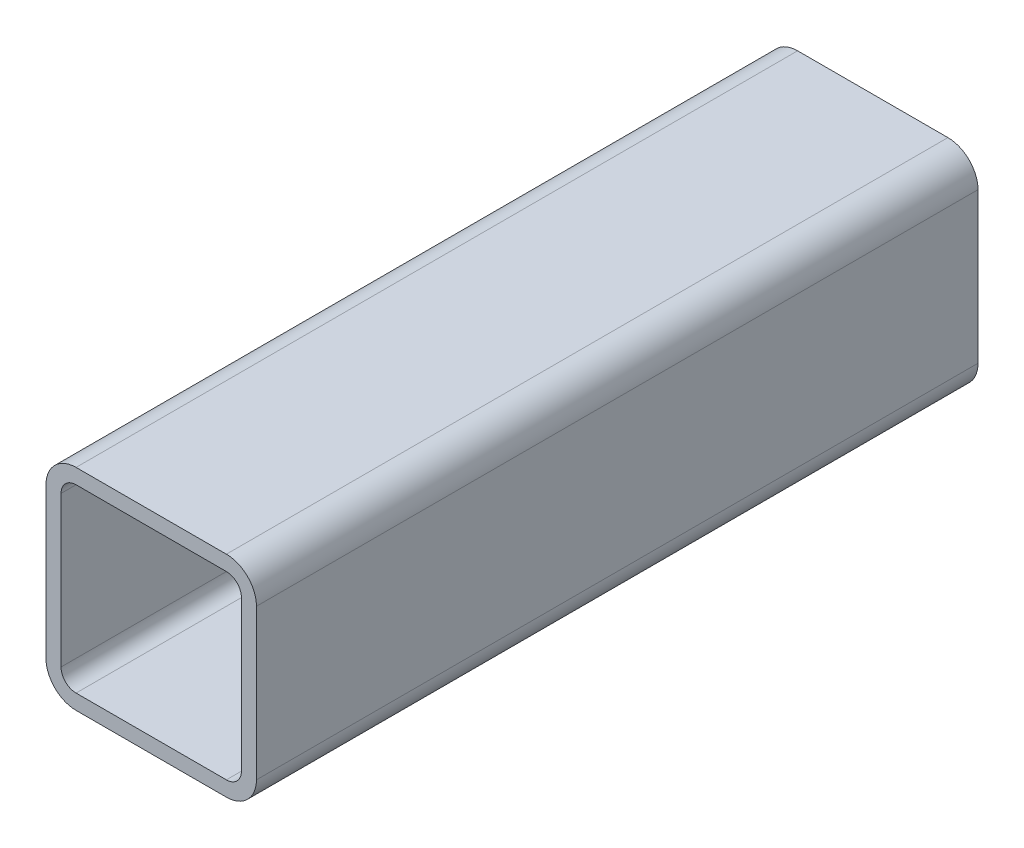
ISO-10303-21;
HEADER;
FILE_DESCRIPTION(('STEP AP214'),'2;1');
FILE_NAME('part.step','',(''),(''),'','','');
FILE_SCHEMA(('AUTOMOTIVE_DESIGN { 1 0 10303 214 1 1 1 1 }'));
ENDSEC;
DATA;
#1=APPLICATION_CONTEXT('core data for automotive mechanical design processes');
#2=APPLICATION_PROTOCOL_DEFINITION('international standard','automotive_design',2000,#1);
#3=PRODUCT_CONTEXT('',#1,'mechanical');
#4=PRODUCT('Part','Part','',(#3));
#5=PRODUCT_RELATED_PRODUCT_CATEGORY('part','',(#4));
#6=PRODUCT_DEFINITION_FORMATION('','',#4);
#7=PRODUCT_DEFINITION_CONTEXT('part definition',#1,'design');
#8=PRODUCT_DEFINITION('design','',#6,#7);
#9=PRODUCT_DEFINITION_SHAPE('','',#8);
#10=(LENGTH_UNIT() NAMED_UNIT(*) SI_UNIT(.MILLI.,.METRE.));
#11=(NAMED_UNIT(*) PLANE_ANGLE_UNIT() SI_UNIT($,.RADIAN.));
#12=(NAMED_UNIT(*) SI_UNIT($,.STERADIAN.) SOLID_ANGLE_UNIT());
#13=UNCERTAINTY_MEASURE_WITH_UNIT(LENGTH_MEASURE(1.E-05),#10,'distance_accuracy_value','');
#14=(GEOMETRIC_REPRESENTATION_CONTEXT(3) GLOBAL_UNCERTAINTY_ASSIGNED_CONTEXT((#13)) GLOBAL_UNIT_ASSIGNED_CONTEXT((#10,
#11,#12)) REPRESENTATION_CONTEXT('',''));
#15=CARTESIAN_POINT('',(0.,0.,0.));
#16=DIRECTION('',(0.,0.,1.));
#17=DIRECTION('',(1.,0.,0.));
#18=AXIS2_PLACEMENT_3D('',#15,#16,#17);
#19=CARTESIAN_POINT('',(14.7821469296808,77.0015103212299,304.8));
#20=DIRECTION('',(0.,0.,1.));
#21=DIRECTION('',(1.,0.,0.));
#22=AXIS2_PLACEMENT_3D('',#19,#20,#21);
#23=PLANE('',#22);
#24=CARTESIAN_POINT('',(14.7821469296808,77.0015103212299,304.8));
#25=DIRECTION('',(0.,0.,1.));
#26=DIRECTION('',(1.,0.,0.));
#27=AXIS2_PLACEMENT_3D('',#24,#25,#26);
#28=CIRCLE('',#27,12.7);
#29=CARTESIAN_POINT('',(14.7821469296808,89.7015103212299,304.8));
#30=VERTEX_POINT('',#29);
#31=CARTESIAN_POINT('',(2.08214692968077,77.0015103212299,304.8));
#32=VERTEX_POINT('',#31);
#33=EDGE_CURVE('E211',#30,#32,#28,.T.);
#34=ORIENTED_EDGE('',*,*,#33,.T.);
#35=DIRECTION('',(0.,-1.,0.));
#36=VECTOR('',#35,1.);
#37=CARTESIAN_POINT('',(2.08214692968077,13.5015103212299,304.8));
#38=LINE('',#37,#36);
#39=CARTESIAN_POINT('',(2.08214692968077,13.5015103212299,304.8));
#40=VERTEX_POINT('',#39);
#41=EDGE_CURVE('E214',#32,#40,#38,.T.);
#42=ORIENTED_EDGE('',*,*,#41,.T.);
#43=CARTESIAN_POINT('',(14.7821469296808,13.5015103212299,304.8));
#44=DIRECTION('',(0.,0.,1.));
#45=DIRECTION('',(1.,0.,0.));
#46=AXIS2_PLACEMENT_3D('',#43,#44,#45);
#47=CIRCLE('',#46,12.7);
#48=CARTESIAN_POINT('',(14.7821469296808,0.801510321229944,304.8));
#49=VERTEX_POINT('',#48);
#50=EDGE_CURVE('E217',#40,#49,#47,.T.);
#51=ORIENTED_EDGE('',*,*,#50,.T.);
#52=DIRECTION('',(1.,0.,0.));
#53=VECTOR('',#52,1.);
#54=CARTESIAN_POINT('',(78.2821469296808,0.801510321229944,304.8));
#55=LINE('',#54,#53);
#56=CARTESIAN_POINT('',(78.2821469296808,0.801510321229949,304.8));
#57=VERTEX_POINT('',#56);
#58=EDGE_CURVE('E219',#49,#57,#55,.T.);
#59=ORIENTED_EDGE('',*,*,#58,.T.);
#60=CARTESIAN_POINT('',(78.2821469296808,13.5015103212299,304.8));
#61=DIRECTION('',(0.,0.,1.));
#62=DIRECTION('',(1.,0.,0.));
#63=AXIS2_PLACEMENT_3D('',#60,#61,#62);
#64=CIRCLE('',#63,12.7);
#65=CARTESIAN_POINT('',(90.9821469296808,13.5015103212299,304.8));
#66=VERTEX_POINT('',#65);
#67=EDGE_CURVE('E221',#57,#66,#64,.T.);
#68=ORIENTED_EDGE('',*,*,#67,.T.);
#69=DIRECTION('',(0.,1.,0.));
#70=VECTOR('',#69,1.);
#71=CARTESIAN_POINT('',(90.9821469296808,77.0015103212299,304.8));
#72=LINE('',#71,#70);
#73=CARTESIAN_POINT('',(90.9821469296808,77.0015103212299,304.8));
#74=VERTEX_POINT('',#73);
#75=EDGE_CURVE('E223',#66,#74,#72,.T.);
#76=ORIENTED_EDGE('',*,*,#75,.T.);
#77=CARTESIAN_POINT('',(78.2821469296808,77.0015103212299,304.8));
#78=DIRECTION('',(0.,0.,1.));
#79=DIRECTION('',(1.,0.,0.));
#80=AXIS2_PLACEMENT_3D('',#77,#78,#79);
#81=CIRCLE('',#80,12.7);
#82=CARTESIAN_POINT('',(78.2821469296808,89.7015103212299,304.8));
#83=VERTEX_POINT('',#82);
#84=EDGE_CURVE('E225',#74,#83,#81,.T.);
#85=ORIENTED_EDGE('',*,*,#84,.T.);
#86=DIRECTION('',(-1.,0.,0.));
#87=VECTOR('',#86,1.);
#88=CARTESIAN_POINT('',(14.7821469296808,89.7015103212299,304.8));
#89=LINE('',#88,#87);
#90=EDGE_CURVE('E227',#83,#30,#89,.T.);
#91=ORIENTED_EDGE('',*,*,#90,.T.);
#92=EDGE_LOOP('',(#34,#42,#51,#59,#68,#76,#85,#91));
#93=FACE_BOUND('',#92,.T.);
#94=DIRECTION('',(0.,-1.,0.));
#95=VECTOR('',#94,1.);
#96=CARTESIAN_POINT('',(8.43214692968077,13.5015103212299,304.8));
#97=LINE('',#96,#95);
#98=CARTESIAN_POINT('',(8.43214692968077,77.0015103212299,304.8));
#99=VERTEX_POINT('',#98);
#100=CARTESIAN_POINT('',(8.43214692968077,13.5015103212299,304.8));
#101=VERTEX_POINT('',#100);
#102=EDGE_CURVE('E154',#99,#101,#97,.T.);
#103=ORIENTED_EDGE('',*,*,#102,.F.);
#104=CARTESIAN_POINT('',(14.7821469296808,77.0015103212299,304.8));
#105=DIRECTION('',(0.,0.,1.));
#106=DIRECTION('',(1.,0.,0.));
#107=AXIS2_PLACEMENT_3D('',#104,#105,#106);
#108=CIRCLE('',#107,6.35);
#109=CARTESIAN_POINT('',(14.7821469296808,83.3515103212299,304.8));
#110=VERTEX_POINT('',#109);
#111=EDGE_CURVE('E146',#110,#99,#108,.T.);
#112=ORIENTED_EDGE('',*,*,#111,.F.);
#113=DIRECTION('',(-1.,0.,0.));
#114=VECTOR('',#113,1.);
#115=CARTESIAN_POINT('',(14.7821469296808,83.3515103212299,304.8));
#116=LINE('',#115,#114);
#117=CARTESIAN_POINT('',(78.2821469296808,83.3515103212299,304.8));
#118=VERTEX_POINT('',#117);
#119=EDGE_CURVE('E179',#118,#110,#116,.T.);
#120=ORIENTED_EDGE('',*,*,#119,.F.);
#121=CARTESIAN_POINT('',(78.2821469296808,77.0015103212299,304.8));
#122=DIRECTION('',(0.,0.,1.));
#123=DIRECTION('',(1.,0.,0.));
#124=AXIS2_PLACEMENT_3D('',#121,#122,#123);
#125=CIRCLE('',#124,6.35);
#126=CARTESIAN_POINT('',(84.6321469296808,77.0015103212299,304.8));
#127=VERTEX_POINT('',#126);
#128=EDGE_CURVE('E177',#127,#118,#125,.T.);
#129=ORIENTED_EDGE('',*,*,#128,.F.);
#130=DIRECTION('',(0.,1.,0.));
#131=VECTOR('',#130,1.);
#132=CARTESIAN_POINT('',(84.6321469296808,77.0015103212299,304.8));
#133=LINE('',#132,#131);
#134=CARTESIAN_POINT('',(84.6321469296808,13.5015103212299,304.8));
#135=VERTEX_POINT('',#134);
#136=EDGE_CURVE('E175',#135,#127,#133,.T.);
#137=ORIENTED_EDGE('',*,*,#136,.F.);
#138=CARTESIAN_POINT('',(78.2821469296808,13.5015103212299,304.8));
#139=DIRECTION('',(0.,0.,1.));
#140=DIRECTION('',(1.,0.,0.));
#141=AXIS2_PLACEMENT_3D('',#138,#139,#140);
#142=CIRCLE('',#141,6.35);
#143=CARTESIAN_POINT('',(78.2821469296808,7.15151032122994,304.8));
#144=VERTEX_POINT('',#143);
#145=EDGE_CURVE('E173',#144,#135,#142,.T.);
#146=ORIENTED_EDGE('',*,*,#145,.F.);
#147=DIRECTION('',(1.,0.,0.));
#148=VECTOR('',#147,1.);
#149=CARTESIAN_POINT('',(78.2821469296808,7.15151032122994,304.8));
#150=LINE('',#149,#148);
#151=CARTESIAN_POINT('',(14.7821469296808,7.15151032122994,304.8));
#152=VERTEX_POINT('',#151);
#153=EDGE_CURVE('E169',#152,#144,#150,.T.);
#154=ORIENTED_EDGE('',*,*,#153,.F.);
#155=CARTESIAN_POINT('',(14.7821469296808,13.5015103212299,304.8));
#156=DIRECTION('',(0.,0.,1.));
#157=DIRECTION('',(1.,0.,0.));
#158=AXIS2_PLACEMENT_3D('',#155,#156,#157);
#159=CIRCLE('',#158,6.35);
#160=EDGE_CURVE('E167',#101,#152,#159,.T.);
#161=ORIENTED_EDGE('',*,*,#160,.F.);
#162=EDGE_LOOP('',(#103,#112,#120,#129,#137,#146,#154,#161));
#163=FACE_BOUND('',#162,.T.);
#164=ADVANCED_FACE('F33',(#93,#163),#23,.T.);
#165=CARTESIAN_POINT('',(14.7821469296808,77.0015103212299,0.));
#166=DIRECTION('',(0.,0.,1.));
#167=DIRECTION('',(1.,0.,0.));
#168=AXIS2_PLACEMENT_3D('',#165,#166,#167);
#169=PLANE('',#168);
#170=CARTESIAN_POINT('',(14.7821469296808,77.0015103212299,0.));
#171=DIRECTION('',(0.,0.,1.));
#172=DIRECTION('',(1.,0.,0.));
#173=AXIS2_PLACEMENT_3D('',#170,#171,#172);
#174=CIRCLE('',#173,12.7);
#175=CARTESIAN_POINT('',(14.7821469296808,89.7015103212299,0.));
#176=VERTEX_POINT('',#175);
#177=CARTESIAN_POINT('',(2.08214692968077,77.0015103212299,0.));
#178=VERTEX_POINT('',#177);
#179=EDGE_CURVE('E162',#176,#178,#174,.T.);
#180=ORIENTED_EDGE('',*,*,#179,.F.);
#181=DIRECTION('',(-1.,0.,0.));
#182=VECTOR('',#181,1.);
#183=CARTESIAN_POINT('',(14.7821469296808,89.7015103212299,0.));
#184=LINE('',#183,#182);
#185=CARTESIAN_POINT('',(78.2821469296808,89.7015103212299,0.));
#186=VERTEX_POINT('',#185);
#187=EDGE_CURVE('E215',#186,#176,#184,.T.);
#188=ORIENTED_EDGE('',*,*,#187,.F.);
#189=CARTESIAN_POINT('',(78.2821469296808,77.0015103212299,0.));
#190=DIRECTION('',(0.,0.,1.));
#191=DIRECTION('',(1.,0.,0.));
#192=AXIS2_PLACEMENT_3D('',#189,#190,#191);
#193=CIRCLE('',#192,12.7);
#194=CARTESIAN_POINT('',(90.9821469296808,77.0015103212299,0.));
#195=VERTEX_POINT('',#194);
#196=EDGE_CURVE('E242',#195,#186,#193,.T.);
#197=ORIENTED_EDGE('',*,*,#196,.F.);
#198=DIRECTION('',(0.,1.,0.));
#199=VECTOR('',#198,1.);
#200=CARTESIAN_POINT('',(90.9821469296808,77.0015103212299,0.));
#201=LINE('',#200,#199);
#202=CARTESIAN_POINT('',(90.9821469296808,13.5015103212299,0.));
#203=VERTEX_POINT('',#202);
#204=EDGE_CURVE('E240',#203,#195,#201,.T.);
#205=ORIENTED_EDGE('',*,*,#204,.F.);
#206=CARTESIAN_POINT('',(78.2821469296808,13.5015103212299,0.));
#207=DIRECTION('',(0.,0.,1.));
#208=DIRECTION('',(1.,0.,0.));
#209=AXIS2_PLACEMENT_3D('',#206,#207,#208);
#210=CIRCLE('',#209,12.7);
#211=CARTESIAN_POINT('',(78.2821469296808,0.801510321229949,0.));
#212=VERTEX_POINT('',#211);
#213=EDGE_CURVE('E238',#212,#203,#210,.T.);
#214=ORIENTED_EDGE('',*,*,#213,.F.);
#215=DIRECTION('',(1.,0.,0.));
#216=VECTOR('',#215,1.);
#217=CARTESIAN_POINT('',(78.2821469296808,0.801510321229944,0.));
#218=LINE('',#217,#216);
#219=CARTESIAN_POINT('',(14.7821469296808,0.801510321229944,0.));
#220=VERTEX_POINT('',#219);
#221=EDGE_CURVE('E236',#220,#212,#218,.T.);
#222=ORIENTED_EDGE('',*,*,#221,.F.);
#223=CARTESIAN_POINT('',(14.7821469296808,13.5015103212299,0.));
#224=DIRECTION('',(0.,0.,1.));
#225=DIRECTION('',(1.,0.,0.));
#226=AXIS2_PLACEMENT_3D('',#223,#224,#225);
#227=CIRCLE('',#226,12.7);
#228=CARTESIAN_POINT('',(2.08214692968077,13.5015103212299,0.));
#229=VERTEX_POINT('',#228);
#230=EDGE_CURVE('E234',#229,#220,#227,.T.);
#231=ORIENTED_EDGE('',*,*,#230,.F.);
#232=DIRECTION('',(0.,-1.,0.));
#233=VECTOR('',#232,1.);
#234=CARTESIAN_POINT('',(2.08214692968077,13.5015103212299,0.));
#235=LINE('',#234,#233);
#236=EDGE_CURVE('E232',#178,#229,#235,.T.);
#237=ORIENTED_EDGE('',*,*,#236,.F.);
#238=EDGE_LOOP('',(#180,#188,#197,#205,#214,#222,#231,#237));
#239=FACE_BOUND('',#238,.T.);
#240=CARTESIAN_POINT('',(14.7821469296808,77.0015103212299,0.));
#241=DIRECTION('',(0.,0.,1.));
#242=DIRECTION('',(1.,0.,0.));
#243=AXIS2_PLACEMENT_3D('',#240,#241,#242);
#244=CIRCLE('',#243,6.35);
#245=CARTESIAN_POINT('',(14.7821469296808,83.3515103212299,0.));
#246=VERTEX_POINT('',#245);
#247=CARTESIAN_POINT('',(8.43214692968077,77.0015103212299,0.));
#248=VERTEX_POINT('',#247);
#249=EDGE_CURVE('E56',#246,#248,#244,.T.);
#250=ORIENTED_EDGE('',*,*,#249,.T.);
#251=DIRECTION('',(0.,-1.,0.));
#252=VECTOR('',#251,1.);
#253=CARTESIAN_POINT('',(8.43214692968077,13.5015103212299,0.));
#254=LINE('',#253,#252);
#255=CARTESIAN_POINT('',(8.43214692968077,13.5015103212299,0.));
#256=VERTEX_POINT('',#255);
#257=EDGE_CURVE('E161',#248,#256,#254,.T.);
#258=ORIENTED_EDGE('',*,*,#257,.T.);
#259=CARTESIAN_POINT('',(14.7821469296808,13.5015103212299,0.));
#260=DIRECTION('',(0.,0.,1.));
#261=DIRECTION('',(1.,0.,0.));
#262=AXIS2_PLACEMENT_3D('',#259,#260,#261);
#263=CIRCLE('',#262,6.35);
#264=CARTESIAN_POINT('',(14.7821469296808,7.15151032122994,0.));
#265=VERTEX_POINT('',#264);
#266=EDGE_CURVE('E183',#256,#265,#263,.T.);
#267=ORIENTED_EDGE('',*,*,#266,.T.);
#268=DIRECTION('',(1.,0.,0.));
#269=VECTOR('',#268,1.);
#270=CARTESIAN_POINT('',(78.2821469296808,7.15151032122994,0.));
#271=LINE('',#270,#269);
#272=CARTESIAN_POINT('',(78.2821469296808,7.15151032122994,0.));
#273=VERTEX_POINT('',#272);
#274=EDGE_CURVE('E186',#265,#273,#271,.T.);
#275=ORIENTED_EDGE('',*,*,#274,.T.);
#276=CARTESIAN_POINT('',(78.2821469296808,13.5015103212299,0.));
#277=DIRECTION('',(0.,0.,1.));
#278=DIRECTION('',(1.,0.,0.));
#279=AXIS2_PLACEMENT_3D('',#276,#277,#278);
#280=CIRCLE('',#279,6.35);
#281=CARTESIAN_POINT('',(84.6321469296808,13.5015103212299,0.));
#282=VERTEX_POINT('',#281);
#283=EDGE_CURVE('E189',#273,#282,#280,.T.);
#284=ORIENTED_EDGE('',*,*,#283,.T.);
#285=DIRECTION('',(0.,1.,0.));
#286=VECTOR('',#285,1.);
#287=CARTESIAN_POINT('',(84.6321469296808,77.0015103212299,0.));
#288=LINE('',#287,#286);
#289=CARTESIAN_POINT('',(84.6321469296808,77.0015103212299,0.));
#290=VERTEX_POINT('',#289);
#291=EDGE_CURVE('E192',#282,#290,#288,.T.);
#292=ORIENTED_EDGE('',*,*,#291,.T.);
#293=CARTESIAN_POINT('',(78.2821469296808,77.0015103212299,0.));
#294=DIRECTION('',(0.,0.,1.));
#295=DIRECTION('',(1.,0.,0.));
#296=AXIS2_PLACEMENT_3D('',#293,#294,#295);
#297=CIRCLE('',#296,6.35);
#298=CARTESIAN_POINT('',(78.2821469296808,83.3515103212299,0.));
#299=VERTEX_POINT('',#298);
#300=EDGE_CURVE('E195',#290,#299,#297,.T.);
#301=ORIENTED_EDGE('',*,*,#300,.T.);
#302=DIRECTION('',(-1.,0.,0.));
#303=VECTOR('',#302,1.);
#304=CARTESIAN_POINT('',(14.7821469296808,83.3515103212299,0.));
#305=LINE('',#304,#303);
#306=EDGE_CURVE('E155',#299,#246,#305,.T.);
#307=ORIENTED_EDGE('',*,*,#306,.T.);
#308=EDGE_LOOP('',(#250,#258,#267,#275,#284,#292,#301,#307));
#309=FACE_BOUND('',#308,.T.);
#310=ADVANCED_FACE('F272',(#239,#309),#169,.F.);
#311=CARTESIAN_POINT('',(14.7821469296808,77.0015103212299,304.8));
#312=DIRECTION('',(0.,0.,-1.));
#313=DIRECTION('',(-1.,0.,0.));
#314=AXIS2_PLACEMENT_3D('',#311,#312,#313);
#315=CYLINDRICAL_SURFACE('',#314,12.7);
#316=ORIENTED_EDGE('',*,*,#179,.T.);
#317=DIRECTION('',(0.,0.,-1.));
#318=VECTOR('',#317,1.);
#319=CARTESIAN_POINT('',(2.08214692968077,77.0015103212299,304.8));
#320=LINE('',#319,#318);
#321=EDGE_CURVE('E11',#32,#178,#320,.T.);
#322=ORIENTED_EDGE('',*,*,#321,.F.);
#323=ORIENTED_EDGE('',*,*,#33,.F.);
#324=DIRECTION('',(0.,0.,-1.));
#325=VECTOR('',#324,1.);
#326=CARTESIAN_POINT('',(14.7821469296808,89.7015103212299,304.8));
#327=LINE('',#326,#325);
#328=EDGE_CURVE('E229',#30,#176,#327,.T.);
#329=ORIENTED_EDGE('',*,*,#328,.T.);
#330=EDGE_LOOP('',(#316,#322,#323,#329));
#331=FACE_BOUND('',#330,.T.);
#332=ADVANCED_FACE('F35',(#331),#315,.T.);
#333=CARTESIAN_POINT('',(2.08214692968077,13.5015103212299,304.8));
#334=DIRECTION('',(1.,0.,0.));
#335=DIRECTION('',(0.,0.,-1.));
#336=AXIS2_PLACEMENT_3D('',#333,#334,#335);
#337=PLANE('',#336);
#338=ORIENTED_EDGE('',*,*,#236,.T.);
#339=DIRECTION('',(0.,0.,-1.));
#340=VECTOR('',#339,1.);
#341=CARTESIAN_POINT('',(2.08214692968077,13.5015103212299,304.8));
#342=LINE('',#341,#340);
#343=EDGE_CURVE('E41',#40,#229,#342,.T.);
#344=ORIENTED_EDGE('',*,*,#343,.F.);
#345=ORIENTED_EDGE('',*,*,#41,.F.);
#346=ORIENTED_EDGE('',*,*,#321,.T.);
#347=EDGE_LOOP('',(#338,#344,#345,#346));
#348=FACE_BOUND('',#347,.T.);
#349=ADVANCED_FACE('F289',(#348),#337,.F.);
#350=CARTESIAN_POINT('',(14.7821469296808,13.5015103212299,304.8));
#351=DIRECTION('',(0.,0.,-1.));
#352=DIRECTION('',(-1.,0.,0.));
#353=AXIS2_PLACEMENT_3D('',#350,#351,#352);
#354=CYLINDRICAL_SURFACE('',#353,12.7);
#355=ORIENTED_EDGE('',*,*,#230,.T.);
#356=DIRECTION('',(0.,0.,-1.));
#357=VECTOR('',#356,1.);
#358=CARTESIAN_POINT('',(14.7821469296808,0.801510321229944,304.8));
#359=LINE('',#358,#357);
#360=EDGE_CURVE('E259',#49,#220,#359,.T.);
#361=ORIENTED_EDGE('',*,*,#360,.F.);
#362=ORIENTED_EDGE('',*,*,#50,.F.);
#363=ORIENTED_EDGE('',*,*,#343,.T.);
#364=EDGE_LOOP('',(#355,#361,#362,#363));
#365=FACE_BOUND('',#364,.T.);
#366=ADVANCED_FACE('F266',(#365),#354,.T.);
#367=CARTESIAN_POINT('',(78.2821469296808,0.801510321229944,304.8));
#368=DIRECTION('',(0.,1.,0.));
#369=DIRECTION('',(0.,0.,1.));
#370=AXIS2_PLACEMENT_3D('',#367,#368,#369);
#371=PLANE('',#370);
#372=ORIENTED_EDGE('',*,*,#221,.T.);
#373=DIRECTION('',(0.,0.,-1.));
#374=VECTOR('',#373,1.);
#375=CARTESIAN_POINT('',(78.2821469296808,0.801510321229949,304.8));
#376=LINE('',#375,#374);
#377=EDGE_CURVE('E256',#57,#212,#376,.T.);
#378=ORIENTED_EDGE('',*,*,#377,.F.);
#379=ORIENTED_EDGE('',*,*,#58,.F.);
#380=ORIENTED_EDGE('',*,*,#360,.T.);
#381=EDGE_LOOP('',(#372,#378,#379,#380));
#382=FACE_BOUND('',#381,.T.);
#383=ADVANCED_FACE('F278',(#382),#371,.F.);
#384=CARTESIAN_POINT('',(78.2821469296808,13.5015103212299,304.8));
#385=DIRECTION('',(0.,0.,-1.));
#386=DIRECTION('',(-1.,0.,0.));
#387=AXIS2_PLACEMENT_3D('',#384,#385,#386);
#388=CYLINDRICAL_SURFACE('',#387,12.7);
#389=ORIENTED_EDGE('',*,*,#213,.T.);
#390=DIRECTION('',(0.,0.,-1.));
#391=VECTOR('',#390,1.);
#392=CARTESIAN_POINT('',(90.9821469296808,13.5015103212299,304.8));
#393=LINE('',#392,#391);
#394=EDGE_CURVE('E253',#66,#203,#393,.T.);
#395=ORIENTED_EDGE('',*,*,#394,.F.);
#396=ORIENTED_EDGE('',*,*,#67,.F.);
#397=ORIENTED_EDGE('',*,*,#377,.T.);
#398=EDGE_LOOP('',(#389,#395,#396,#397));
#399=FACE_BOUND('',#398,.T.);
#400=ADVANCED_FACE('F282',(#399),#388,.T.);
#401=CARTESIAN_POINT('',(90.9821469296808,77.0015103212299,304.8));
#402=DIRECTION('',(-1.,0.,0.));
#403=DIRECTION('',(0.,0.,1.));
#404=AXIS2_PLACEMENT_3D('',#401,#402,#403);
#405=PLANE('',#404);
#406=ORIENTED_EDGE('',*,*,#204,.T.);
#407=DIRECTION('',(0.,0.,-1.));
#408=VECTOR('',#407,1.);
#409=CARTESIAN_POINT('',(90.9821469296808,77.0015103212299,304.8));
#410=LINE('',#409,#408);
#411=EDGE_CURVE('E250',#74,#195,#410,.T.);
#412=ORIENTED_EDGE('',*,*,#411,.F.);
#413=ORIENTED_EDGE('',*,*,#75,.F.);
#414=ORIENTED_EDGE('',*,*,#394,.T.);
#415=EDGE_LOOP('',(#406,#412,#413,#414));
#416=FACE_BOUND('',#415,.T.);
#417=ADVANCED_FACE('F302',(#416),#405,.F.);
#418=CARTESIAN_POINT('',(78.2821469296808,77.0015103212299,304.8));
#419=DIRECTION('',(0.,0.,-1.));
#420=DIRECTION('',(-1.,0.,0.));
#421=AXIS2_PLACEMENT_3D('',#418,#419,#420);
#422=CYLINDRICAL_SURFACE('',#421,12.7);
#423=ORIENTED_EDGE('',*,*,#196,.T.);
#424=DIRECTION('',(0.,0.,-1.));
#425=VECTOR('',#424,1.);
#426=CARTESIAN_POINT('',(78.2821469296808,89.7015103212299,304.8));
#427=LINE('',#426,#425);
#428=EDGE_CURVE('E247',#83,#186,#427,.T.);
#429=ORIENTED_EDGE('',*,*,#428,.F.);
#430=ORIENTED_EDGE('',*,*,#84,.F.);
#431=ORIENTED_EDGE('',*,*,#411,.T.);
#432=EDGE_LOOP('',(#423,#429,#430,#431));
#433=FACE_BOUND('',#432,.T.);
#434=ADVANCED_FACE('F300',(#433),#422,.T.);
#435=CARTESIAN_POINT('',(14.7821469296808,89.7015103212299,304.8));
#436=DIRECTION('',(0.,-1.,0.));
#437=DIRECTION('',(0.,0.,-1.));
#438=AXIS2_PLACEMENT_3D('',#435,#436,#437);
#439=PLANE('',#438);
#440=ORIENTED_EDGE('',*,*,#187,.T.);
#441=ORIENTED_EDGE('',*,*,#328,.F.);
#442=ORIENTED_EDGE('',*,*,#90,.F.);
#443=ORIENTED_EDGE('',*,*,#428,.T.);
#444=EDGE_LOOP('',(#440,#441,#442,#443));
#445=FACE_BOUND('',#444,.T.);
#446=ADVANCED_FACE('F295',(#445),#439,.F.);
#447=CARTESIAN_POINT('',(14.7821469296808,77.0015103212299,304.8));
#448=DIRECTION('',(0.,0.,-1.));
#449=DIRECTION('',(-1.,0.,0.));
#450=AXIS2_PLACEMENT_3D('',#447,#448,#449);
#451=CYLINDRICAL_SURFACE('',#450,6.35);
#452=ORIENTED_EDGE('',*,*,#249,.F.);
#453=DIRECTION('',(0.,0.,-1.));
#454=VECTOR('',#453,1.);
#455=CARTESIAN_POINT('',(14.7821469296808,83.3515103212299,304.8));
#456=LINE('',#455,#454);
#457=EDGE_CURVE('E150',#110,#246,#456,.T.);
#458=ORIENTED_EDGE('',*,*,#457,.F.);
#459=ORIENTED_EDGE('',*,*,#111,.T.);
#460=DIRECTION('',(0.,0.,-1.));
#461=VECTOR('',#460,1.);
#462=CARTESIAN_POINT('',(8.43214692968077,77.0015103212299,304.8));
#463=LINE('',#462,#461);
#464=EDGE_CURVE('E149',#99,#248,#463,.T.);
#465=ORIENTED_EDGE('',*,*,#464,.T.);
#466=EDGE_LOOP('',(#452,#458,#459,#465));
#467=FACE_BOUND('',#466,.T.);
#468=ADVANCED_FACE('F148',(#467),#451,.F.);
#469=CARTESIAN_POINT('',(8.43214692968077,13.5015103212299,304.8));
#470=DIRECTION('',(1.,0.,0.));
#471=DIRECTION('',(0.,0.,-1.));
#472=AXIS2_PLACEMENT_3D('',#469,#470,#471);
#473=PLANE('',#472);
#474=ORIENTED_EDGE('',*,*,#257,.F.);
#475=ORIENTED_EDGE('',*,*,#464,.F.);
#476=ORIENTED_EDGE('',*,*,#102,.T.);
#477=DIRECTION('',(0.,0.,-1.));
#478=VECTOR('',#477,1.);
#479=CARTESIAN_POINT('',(8.43214692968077,13.5015103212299,304.8));
#480=LINE('',#479,#478);
#481=EDGE_CURVE('E163',#101,#256,#480,.T.);
#482=ORIENTED_EDGE('',*,*,#481,.T.);
#483=EDGE_LOOP('',(#474,#475,#476,#482));
#484=FACE_BOUND('',#483,.T.);
#485=ADVANCED_FACE('F158',(#484),#473,.T.);
#486=CARTESIAN_POINT('',(14.7821469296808,13.5015103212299,304.8));
#487=DIRECTION('',(0.,0.,-1.));
#488=DIRECTION('',(-1.,0.,0.));
#489=AXIS2_PLACEMENT_3D('',#486,#487,#488);
#490=CYLINDRICAL_SURFACE('',#489,6.35);
#491=ORIENTED_EDGE('',*,*,#266,.F.);
#492=ORIENTED_EDGE('',*,*,#481,.F.);
#493=ORIENTED_EDGE('',*,*,#160,.T.);
#494=DIRECTION('',(0.,0.,-1.));
#495=VECTOR('',#494,1.);
#496=CARTESIAN_POINT('',(14.7821469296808,7.15151032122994,304.8));
#497=LINE('',#496,#495);
#498=EDGE_CURVE('E208',#152,#265,#497,.T.);
#499=ORIENTED_EDGE('',*,*,#498,.T.);
#500=EDGE_LOOP('',(#491,#492,#493,#499));
#501=FACE_BOUND('',#500,.T.);
#502=ADVANCED_FACE('F327',(#501),#490,.F.);
#503=CARTESIAN_POINT('',(78.2821469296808,7.15151032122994,304.8));
#504=DIRECTION('',(0.,1.,0.));
#505=DIRECTION('',(0.,0.,1.));
#506=AXIS2_PLACEMENT_3D('',#503,#504,#505);
#507=PLANE('',#506);
#508=ORIENTED_EDGE('',*,*,#274,.F.);
#509=ORIENTED_EDGE('',*,*,#498,.F.);
#510=ORIENTED_EDGE('',*,*,#153,.T.);
#511=DIRECTION('',(0.,0.,-1.));
#512=VECTOR('',#511,1.);
#513=CARTESIAN_POINT('',(78.2821469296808,7.15151032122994,304.8));
#514=LINE('',#513,#512);
#515=EDGE_CURVE('E206',#144,#273,#514,.T.);
#516=ORIENTED_EDGE('',*,*,#515,.T.);
#517=EDGE_LOOP('',(#508,#509,#510,#516));
#518=FACE_BOUND('',#517,.T.);
#519=ADVANCED_FACE('F331',(#518),#507,.T.);
#520=CARTESIAN_POINT('',(78.2821469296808,13.5015103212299,304.8));
#521=DIRECTION('',(0.,0.,-1.));
#522=DIRECTION('',(-1.,0.,0.));
#523=AXIS2_PLACEMENT_3D('',#520,#521,#522);
#524=CYLINDRICAL_SURFACE('',#523,6.35);
#525=ORIENTED_EDGE('',*,*,#283,.F.);
#526=ORIENTED_EDGE('',*,*,#515,.F.);
#527=ORIENTED_EDGE('',*,*,#145,.T.);
#528=DIRECTION('',(0.,0.,-1.));
#529=VECTOR('',#528,1.);
#530=CARTESIAN_POINT('',(84.6321469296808,13.5015103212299,304.8));
#531=LINE('',#530,#529);
#532=EDGE_CURVE('E204',#135,#282,#531,.T.);
#533=ORIENTED_EDGE('',*,*,#532,.T.);
#534=EDGE_LOOP('',(#525,#526,#527,#533));
#535=FACE_BOUND('',#534,.T.);
#536=ADVANCED_FACE('F337',(#535),#524,.F.);
#537=CARTESIAN_POINT('',(84.6321469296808,77.0015103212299,304.8));
#538=DIRECTION('',(-1.,0.,0.));
#539=DIRECTION('',(0.,0.,1.));
#540=AXIS2_PLACEMENT_3D('',#537,#538,#539);
#541=PLANE('',#540);
#542=ORIENTED_EDGE('',*,*,#291,.F.);
#543=ORIENTED_EDGE('',*,*,#532,.F.);
#544=ORIENTED_EDGE('',*,*,#136,.T.);
#545=DIRECTION('',(0.,0.,-1.));
#546=VECTOR('',#545,1.);
#547=CARTESIAN_POINT('',(84.6321469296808,77.0015103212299,304.8));
#548=LINE('',#547,#546);
#549=EDGE_CURVE('E202',#127,#290,#548,.T.);
#550=ORIENTED_EDGE('',*,*,#549,.T.);
#551=EDGE_LOOP('',(#542,#543,#544,#550));
#552=FACE_BOUND('',#551,.T.);
#553=ADVANCED_FACE('F341',(#552),#541,.T.);
#554=CARTESIAN_POINT('',(78.2821469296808,77.0015103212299,304.8));
#555=DIRECTION('',(0.,0.,-1.));
#556=DIRECTION('',(-1.,0.,0.));
#557=AXIS2_PLACEMENT_3D('',#554,#555,#556);
#558=CYLINDRICAL_SURFACE('',#557,6.35);
#559=ORIENTED_EDGE('',*,*,#300,.F.);
#560=ORIENTED_EDGE('',*,*,#549,.F.);
#561=ORIENTED_EDGE('',*,*,#128,.T.);
#562=DIRECTION('',(0.,0.,-1.));
#563=VECTOR('',#562,1.);
#564=CARTESIAN_POINT('',(78.2821469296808,83.3515103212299,304.8));
#565=LINE('',#564,#563);
#566=EDGE_CURVE('E48',#118,#299,#565,.T.);
#567=ORIENTED_EDGE('',*,*,#566,.T.);
#568=EDGE_LOOP('',(#559,#560,#561,#567));
#569=FACE_BOUND('',#568,.T.);
#570=ADVANCED_FACE('F345',(#569),#558,.F.);
#571=CARTESIAN_POINT('',(14.7821469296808,83.3515103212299,304.8));
#572=DIRECTION('',(0.,-1.,0.));
#573=DIRECTION('',(0.,0.,-1.));
#574=AXIS2_PLACEMENT_3D('',#571,#572,#573);
#575=PLANE('',#574);
#576=ORIENTED_EDGE('',*,*,#306,.F.);
#577=ORIENTED_EDGE('',*,*,#566,.F.);
#578=ORIENTED_EDGE('',*,*,#119,.T.);
#579=ORIENTED_EDGE('',*,*,#457,.T.);
#580=EDGE_LOOP('',(#576,#577,#578,#579));
#581=FACE_BOUND('',#580,.T.);
#582=ADVANCED_FACE('F349',(#581),#575,.T.);
#583=CLOSED_SHELL('',(#164,#310,#332,#349,#366,#383,#400,#417,#434,#446,#468,#485,#502,#519,
#536,#553,#570,#582));
#584=MANIFOLD_SOLID_BREP('B2',#583);
#585=ADVANCED_BREP_SHAPE_REPRESENTATION('',(#18,#584),#14);
#586=SHAPE_DEFINITION_REPRESENTATION(#9,#585);
ENDSEC;
END-ISO-10303-21;
